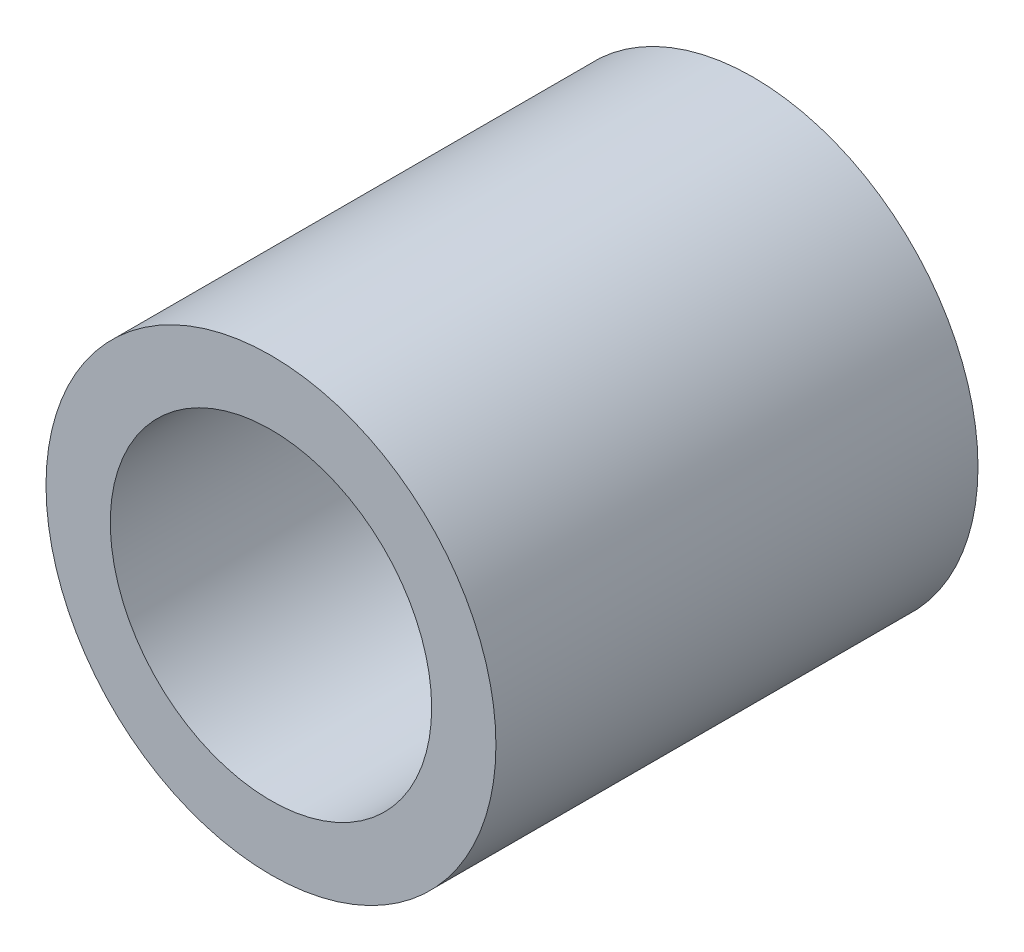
from build123d import *

# Parameters (mm, degrees)
ESQUISSE1_R      = 7
ESQUISSE1_R_2    = 5
EXTRUSION1_DEPTH = 15


with BuildPart() as part:
    # Esquisse1 → Extrusion1 (new body)
    with BuildSketch(Plane.XY):
        Circle(ESQUISSE1_R)
        Circle(ESQUISSE1_R_2, mode=Mode.SUBTRACT)
    extrude(amount=EXTRUSION1_DEPTH)


solid = part.part
